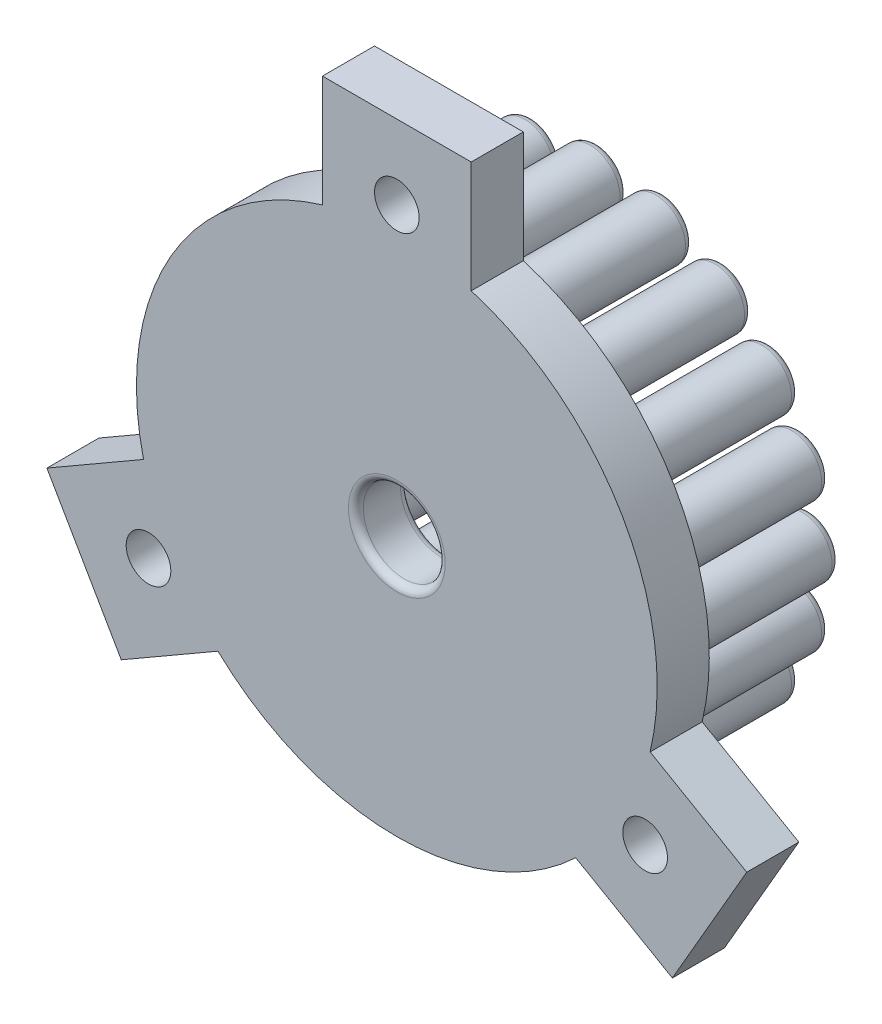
from build123d import *

# Parameters (mm, degrees)
SKIZZE1_R                          = 4
AUFSATZ_LINEAR_AUSTRAGEN1_DEPTH    = 20
AUFSATZ_LINEAR_AUSTRAGEN1_2_DEPTH  = 20
AUFSATZ_LINEAR_AUSTRAGEN1_3_DEPTH  = 20
AUFSATZ_LINEAR_AUSTRAGEN1_4_DEPTH  = 20
AUFSATZ_LINEAR_AUSTRAGEN1_5_DEPTH  = 20
AUFSATZ_LINEAR_AUSTRAGEN1_6_DEPTH  = 20
AUFSATZ_LINEAR_AUSTRAGEN1_7_DEPTH  = 20
AUFSATZ_LINEAR_AUSTRAGEN1_8_DEPTH  = 20
AUFSATZ_LINEAR_AUSTRAGEN1_9_DEPTH  = 20
AUFSATZ_LINEAR_AUSTRAGEN1_10_DEPTH = 20
AUFSATZ_LINEAR_AUSTRAGEN1_11_DEPTH = 20
AUFSATZ_LINEAR_AUSTRAGEN1_12_DEPTH = 20
AUFSATZ_LINEAR_AUSTRAGEN1_13_DEPTH = 20
AUFSATZ_LINEAR_AUSTRAGEN1_14_DEPTH = 20
AUFSATZ_LINEAR_AUSTRAGEN1_15_DEPTH = 20
AUFSATZ_LINEAR_AUSTRAGEN1_16_DEPTH = 20
AUFSATZ_LINEAR_AUSTRAGEN1_17_DEPTH = 20
AUFSATZ_LINEAR_AUSTRAGEN1_18_DEPTH = 20
AUFSATZ_LINEAR_AUSTRAGEN1_19_DEPTH = 20
AUFSATZ_LINEAR_AUSTRAGEN1_20_DEPTH = 20
SKIZZE5_R                          = 35
AUFSATZ_LINEAR_AUSTRAGEN2_DEPTH    = 7
SKIZZE6_R                          = 5.5
SCHNITT_LINEAR_AUSTRAGEN1_DEPTH    = 10
SKIZZE7_W                          = 20
SKIZZE7_H                          = 15
AUFSATZ_LINEAR_AUSTRAGEN3_DEPTH    = 7
SCHNITT_LINEAR_AUSTRAGEN3_REACH    = 74.786
SKIZZE9_R                          = 3
VERRUNDUNG1_R                      = 1
VERRUNDUNG2_R                      = 1


with BuildPart() as part:
    # Skizze1 → Aufsatz-Linear austragen1 (new body)
    with BuildSketch(Plane.XY):
        with Locations((0, 28.5)):
            Circle(SKIZZE1_R)
    extrude(amount=AUFSATZ_LINEAR_AUSTRAGEN1_DEPTH)



with BuildPart() as body_2:
    # Skizze1 → Aufsatz-Linear austragen1 2 (new body)
    with BuildSketch(Plane.XY):
        with Locations((8.80698434, 27.105110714)):
            Circle(SKIZZE1_R)
    extrude(amount=AUFSATZ_LINEAR_AUSTRAGEN1_2_DEPTH)


with BuildPart() as body_3:
    # Skizze1 → Aufsatz-Linear austragen1 3 (new body)
    with BuildSketch(Plane.XY):
        with Locations((16.75187969, 23.05698434)):
            Circle(SKIZZE1_R)
    extrude(amount=AUFSATZ_LINEAR_AUSTRAGEN1_3_DEPTH)


with BuildPart() as body_4:
    # Skizze1 → Aufsatz-Linear austragen1 4 (new body)
    with BuildSketch(Plane.XY):
        with Locations((23.05698434, 16.75187969)):
            Circle(SKIZZE1_R)
    extrude(amount=AUFSATZ_LINEAR_AUSTRAGEN1_4_DEPTH)


with BuildPart() as body_5:
    # Skizze1 → Aufsatz-Linear austragen1 5 (new body)
    with BuildSketch(Plane.XY):
        with Locations((27.105110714, 8.80698434)):
            Circle(SKIZZE1_R)
    extrude(amount=AUFSATZ_LINEAR_AUSTRAGEN1_5_DEPTH)


with BuildPart() as body_6:
    # Skizze1 → Aufsatz-Linear austragen1 6 (new body)
    with BuildSketch(Plane.XY):
        with Locations((28.5, 0)):
            Circle(SKIZZE1_R)
    extrude(amount=AUFSATZ_LINEAR_AUSTRAGEN1_6_DEPTH)


with BuildPart() as body_7:
    # Skizze1 → Aufsatz-Linear austragen1 7 (new body)
    with BuildSketch(Plane.XY):
        with Locations((27.105110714, -8.80698434)):
            Circle(SKIZZE1_R)
    extrude(amount=AUFSATZ_LINEAR_AUSTRAGEN1_7_DEPTH)


with BuildPart() as body_8:
    # Skizze1 → Aufsatz-Linear austragen1 8 (new body)
    with BuildSketch(Plane.XY):
        with Locations((23.05698434, -16.75187969)):
            Circle(SKIZZE1_R)
    extrude(amount=AUFSATZ_LINEAR_AUSTRAGEN1_8_DEPTH)


with BuildPart() as body_9:
    # Skizze1 → Aufsatz-Linear austragen1 9 (new body)
    with BuildSketch(Plane.XY):
        with Locations((16.75187969, -23.05698434)):
            Circle(SKIZZE1_R)
    extrude(amount=AUFSATZ_LINEAR_AUSTRAGEN1_9_DEPTH)


with BuildPart() as body_10:
    # Skizze1 → Aufsatz-Linear austragen1 10 (new body)
    with BuildSketch(Plane.XY):
        with Locations((8.80698434, -27.105110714)):
            Circle(SKIZZE1_R)
    extrude(amount=AUFSATZ_LINEAR_AUSTRAGEN1_10_DEPTH)


with BuildPart() as body_11:
    # Skizze1 → Aufsatz-Linear austragen1 11 (new body)
    with BuildSketch(Plane.XY):
        with Locations((0, -28.5)):
            Circle(SKIZZE1_R)
    extrude(amount=AUFSATZ_LINEAR_AUSTRAGEN1_11_DEPTH)


with BuildPart() as body_12:
    # Skizze1 → Aufsatz-Linear austragen1 12 (new body)
    with BuildSketch(Plane.XY):
        with Locations((-8.80698434, -27.105110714)):
            Circle(SKIZZE1_R)
    extrude(amount=AUFSATZ_LINEAR_AUSTRAGEN1_12_DEPTH)


with BuildPart() as body_13:
    # Skizze1 → Aufsatz-Linear austragen1 13 (new body)
    with BuildSketch(Plane.XY):
        with Locations((-16.75187969, -23.05698434)):
            Circle(SKIZZE1_R)
    extrude(amount=AUFSATZ_LINEAR_AUSTRAGEN1_13_DEPTH)


with BuildPart() as body_14:
    # Skizze1 → Aufsatz-Linear austragen1 14 (new body)
    with BuildSketch(Plane.XY):
        with Locations((-23.05698434, -16.75187969)):
            Circle(SKIZZE1_R)
    extrude(amount=AUFSATZ_LINEAR_AUSTRAGEN1_14_DEPTH)


with BuildPart() as body_15:
    # Skizze1 → Aufsatz-Linear austragen1 15 (new body)
    with BuildSketch(Plane.XY):
        with Locations((-27.105110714, -8.80698434)):
            Circle(SKIZZE1_R)
    extrude(amount=AUFSATZ_LINEAR_AUSTRAGEN1_15_DEPTH)


with BuildPart() as body_16:
    # Skizze1 → Aufsatz-Linear austragen1 16 (new body)
    with BuildSketch(Plane.XY):
        with Locations((-28.5, 0)):
            Circle(SKIZZE1_R)
    extrude(amount=AUFSATZ_LINEAR_AUSTRAGEN1_16_DEPTH)


with BuildPart() as body_17:
    # Skizze1 → Aufsatz-Linear austragen1 17 (new body)
    with BuildSketch(Plane.XY):
        with Locations((-27.105110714, 8.80698434)):
            Circle(SKIZZE1_R)
    extrude(amount=AUFSATZ_LINEAR_AUSTRAGEN1_17_DEPTH)


with BuildPart() as body_18:
    # Skizze1 → Aufsatz-Linear austragen1 18 (new body)
    with BuildSketch(Plane.XY):
        with Locations((-23.05698434, 16.75187969)):
            Circle(SKIZZE1_R)
    extrude(amount=AUFSATZ_LINEAR_AUSTRAGEN1_18_DEPTH)


with BuildPart() as body_19:
    # Skizze1 → Aufsatz-Linear austragen1 19 (new body)
    with BuildSketch(Plane.XY):
        with Locations((-16.75187969, 23.05698434)):
            Circle(SKIZZE1_R)
    extrude(amount=AUFSATZ_LINEAR_AUSTRAGEN1_19_DEPTH)


with BuildPart() as body_20:
    # Skizze1 → Aufsatz-Linear austragen1 20 (new body)
    with BuildSketch(Plane.XY):
        with Locations((-8.80698434, 27.105110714)):
            Circle(SKIZZE1_R)
    extrude(amount=AUFSATZ_LINEAR_AUSTRAGEN1_20_DEPTH)


with BuildPart() as part_1:
    add(part.part)

    add(body_2.part)  # Aufsatz-Linear austragen2 merges body 2

    add(body_3.part)  # Aufsatz-Linear austragen2 merges body 3

    add(body_4.part)  # Aufsatz-Linear austragen2 merges body 4

    add(body_5.part)  # Aufsatz-Linear austragen2 merges body 5

    add(body_6.part)  # Aufsatz-Linear austragen2 merges body 6

    add(body_7.part)  # Aufsatz-Linear austragen2 merges body 7

    add(body_8.part)  # Aufsatz-Linear austragen2 merges body 8

    add(body_9.part)  # Aufsatz-Linear austragen2 merges body 9

    add(body_10.part)  # Aufsatz-Linear austragen2 merges body 10

    add(body_11.part)  # Aufsatz-Linear austragen2 merges body 11

    add(body_12.part)  # Aufsatz-Linear austragen2 merges body 12

    add(body_13.part)  # Aufsatz-Linear austragen2 merges body 13

    add(body_14.part)  # Aufsatz-Linear austragen2 merges body 14

    add(body_15.part)  # Aufsatz-Linear austragen2 merges body 15

    add(body_16.part)  # Aufsatz-Linear austragen2 merges body 16

    add(body_17.part)  # Aufsatz-Linear austragen2 merges body 17

    add(body_18.part)  # Aufsatz-Linear austragen2 merges body 18

    add(body_19.part)  # Aufsatz-Linear austragen2 merges body 19

    add(body_20.part)  # Aufsatz-Linear austragen2 merges body 20
    # Skizze5 → Aufsatz-Linear austragen2 (add)
    with BuildSketch(Plane.XY.offset(20)):
        Circle(SKIZZE5_R)
    extrude(amount=AUFSATZ_LINEAR_AUSTRAGEN2_DEPTH)

    # Skizze6 → Schnitt-Linear austragen1 (cut)
    with BuildSketch(Plane.XY.offset(27)):
        Circle(SKIZZE6_R)
    extrude(amount=-SCHNITT_LINEAR_AUSTRAGEN1_DEPTH, mode=Mode.SUBTRACT)

    # Skizze7 → Aufsatz-Linear austragen3 (add)
    with BuildSketch(Plane.XY.offset(27)):
        with Locations((0, 41.041019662)):
            Rectangle(SKIZZE7_W, SKIZZE7_H)
        Polygon((34.047375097, -8.110255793), (47.037756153, -15.610255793), (37.037756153, -32.930763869), (24.047375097, -25.430763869), align=None)
        Polygon((-24.047375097, -25.430763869), (-37.037756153, -32.930763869), (-47.037756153, -15.610255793), (-34.047375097, -8.110255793), align=None)
    extrude(amount=-AUFSATZ_LINEAR_AUSTRAGEN3_DEPTH)

    # Skizze9 → Schnitt-Linear austragen3 (cut, up to next)
    with BuildSketch(Plane.XY.offset(27), mode=Mode.PRIVATE) as schnitt_linear_austragen3_sk1:
        with Locations((0, 38.541019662)):
            Circle(SKIZZE9_R)
    schnitt_linear_austragen3_tool1 = extrude(schnitt_linear_austragen3_sk1.sketch, amount=-SCHNITT_LINEAR_AUSTRAGEN3_REACH, mode=Mode.PRIVATE) & part_1.part
    # Skizze9 → Schnitt-Linear austragen3 (cut, up to next)
    with BuildSketch(Plane.XY.offset(27), mode=Mode.PRIVATE) as schnitt_linear_austragen3_sk2:
        with Locations((33.377502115, -19.270509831)):
            Circle(SKIZZE9_R)
    schnitt_linear_austragen3_tool2 = extrude(schnitt_linear_austragen3_sk2.sketch, amount=-SCHNITT_LINEAR_AUSTRAGEN3_REACH, mode=Mode.PRIVATE) & part_1.part
    # Skizze9 → Schnitt-Linear austragen3 (cut, up to next)
    with BuildSketch(Plane.XY.offset(27), mode=Mode.PRIVATE) as schnitt_linear_austragen3_sk3:
        with Locations((-33.377502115, -19.270509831)):
            Circle(SKIZZE9_R)
    schnitt_linear_austragen3_tool3 = extrude(schnitt_linear_austragen3_sk3.sketch, amount=-SCHNITT_LINEAR_AUSTRAGEN3_REACH, mode=Mode.PRIVATE) & part_1.part
    add(schnitt_linear_austragen3_tool1.solids().sort_by_distance((0, 38.54102, 27))[0], mode=Mode.SUBTRACT)
    add(schnitt_linear_austragen3_tool2.solids().sort_by_distance((33.377502, -19.27051, 27))[0], mode=Mode.SUBTRACT)
    add(schnitt_linear_austragen3_tool3.solids().sort_by_distance((-33.377502, -19.27051, 27))[0], mode=Mode.SUBTRACT)

    # Verrundung1
    verrundung1_edges = [part_1.edges().sort_by_distance(p)[0] for p in [
        (-5.5, 0, 20),
        (-5.5, 0, 27),
    ]]
    fillet(verrundung1_edges, radius=VERRUNDUNG1_R)

    # Verrundung2
    verrundung2_edges = [part_1.edges().sort_by_distance(p)[0] for p in [
        (24.5, 0, 0),
        (-27.05698434, -16.75187969, 0),
        (-31.105110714, -8.80698434, 0),
        (-32.5, 0, 0),
        (-31.105110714, 8.80698434, 0),
        (-27.05698434, 16.75187969, 0),
        (-20.75187969, 23.05698434, 0),
        (-12.80698434, 27.105110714, 0),
        (23.105110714, 8.80698434, 0),
        (19.05698434, 16.75187969, 0),
        (12.75187969, 23.05698434, 0),
        (4.80698434, 27.105110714, 0),
        (-4, 28.5, 0),
        (-20.75187969, -23.05698434, 0),
        (-12.80698434, -27.105110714, 0),
        (-4, -28.5, 0),
        (4.80698434, -27.105110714, 0),
        (12.75187969, -23.05698434, 0),
        (19.05698434, -16.75187969, 0),
        (23.105110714, -8.80698434, 0),
    ]]
    fillet(verrundung2_edges, radius=VERRUNDUNG2_R)


solid = part_1.part
